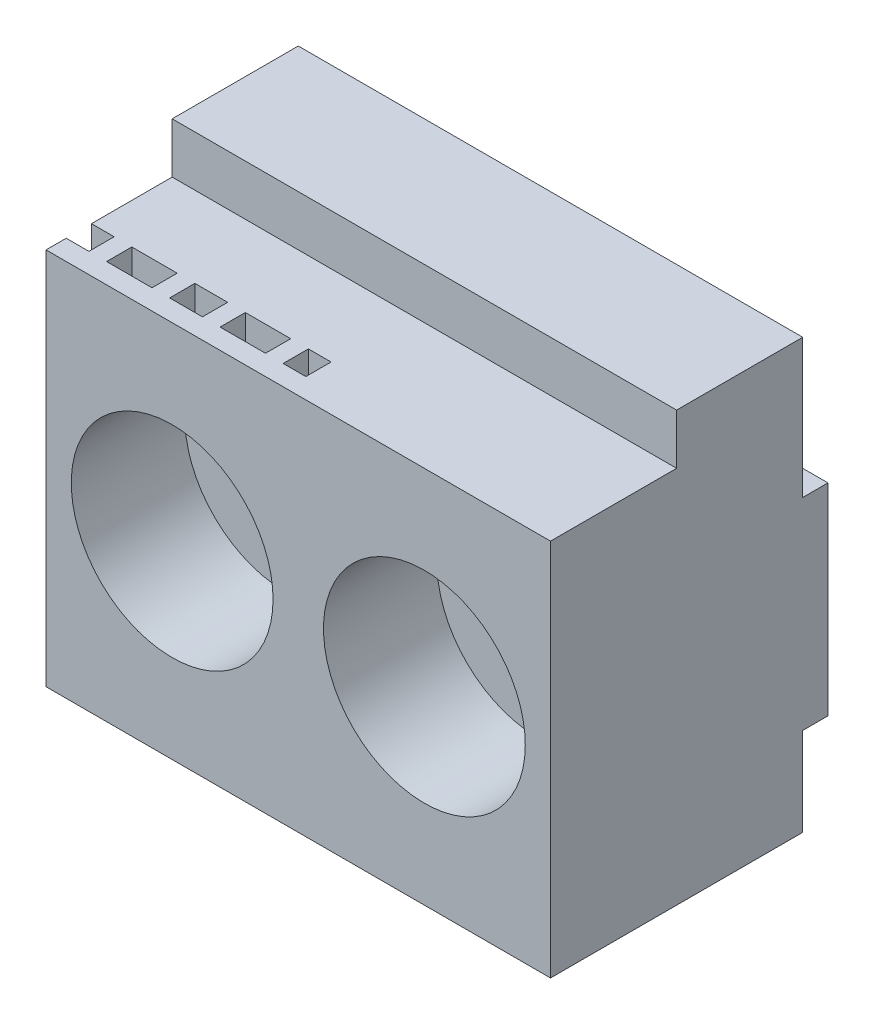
ISO-10303-21;
HEADER;
FILE_DESCRIPTION(('STEP AP214'),'2;1');
FILE_NAME('part.step','',(''),(''),'','','');
FILE_SCHEMA(('AUTOMOTIVE_DESIGN { 1 0 10303 214 1 1 1 1 }'));
ENDSEC;
DATA;
#1=APPLICATION_CONTEXT('core data for automotive mechanical design processes');
#2=APPLICATION_PROTOCOL_DEFINITION('international standard','automotive_design',2000,#1);
#3=PRODUCT_CONTEXT('',#1,'mechanical');
#4=PRODUCT('Part','Part','',(#3));
#5=PRODUCT_RELATED_PRODUCT_CATEGORY('part','',(#4));
#6=PRODUCT_DEFINITION_FORMATION('','',#4);
#7=PRODUCT_DEFINITION_CONTEXT('part definition',#1,'design');
#8=PRODUCT_DEFINITION('design','',#6,#7);
#9=PRODUCT_DEFINITION_SHAPE('','',#8);
#10=(LENGTH_UNIT() NAMED_UNIT(*) SI_UNIT(.MILLI.,.METRE.));
#11=(NAMED_UNIT(*) PLANE_ANGLE_UNIT() SI_UNIT($,.RADIAN.));
#12=(NAMED_UNIT(*) SI_UNIT($,.STERADIAN.) SOLID_ANGLE_UNIT());
#13=UNCERTAINTY_MEASURE_WITH_UNIT(LENGTH_MEASURE(1.E-05),#10,'distance_accuracy_value','');
#14=(GEOMETRIC_REPRESENTATION_CONTEXT(3) GLOBAL_UNCERTAINTY_ASSIGNED_CONTEXT((#13)) GLOBAL_UNIT_ASSIGNED_CONTEXT((#10,
#11,#12)) REPRESENTATION_CONTEXT('',''));
#15=CARTESIAN_POINT('',(0.,0.,0.));
#16=DIRECTION('',(0.,0.,1.));
#17=DIRECTION('',(1.,0.,0.));
#18=AXIS2_PLACEMENT_3D('',#15,#16,#17);
#19=CARTESIAN_POINT('',(20.,0.,11.));
#20=DIRECTION('',(0.,0.,1.));
#21=DIRECTION('',(1.,0.,0.));
#22=AXIS2_PLACEMENT_3D('',#19,#20,#21);
#23=PLANE('',#22);
#24=CARTESIAN_POINT('',(5.,7.50000000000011,11.));
#25=DIRECTION('',(0.,0.,1.));
#26=DIRECTION('',(1.,0.,0.));
#27=AXIS2_PLACEMENT_3D('',#24,#25,#26);
#28=CIRCLE('',#27,4.);
#29=CARTESIAN_POINT('',(9.,7.50000000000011,11.));
#30=VERTEX_POINT('',#29);
#31=EDGE_CURVE('E459',#30,#30,#28,.T.);
#32=ORIENTED_EDGE('',*,*,#31,.F.);
#33=EDGE_LOOP('',(#32));
#34=FACE_BOUND('',#33,.T.);
#35=CARTESIAN_POINT('',(15.,7.50000000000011,11.));
#36=DIRECTION('',(0.,0.,1.));
#37=DIRECTION('',(1.,0.,0.));
#38=AXIS2_PLACEMENT_3D('',#35,#36,#37);
#39=CIRCLE('',#38,4.);
#40=CARTESIAN_POINT('',(19.,7.50000000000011,11.));
#41=VERTEX_POINT('',#40);
#42=EDGE_CURVE('E431',#41,#41,#39,.T.);
#43=ORIENTED_EDGE('',*,*,#42,.F.);
#44=EDGE_LOOP('',(#43));
#45=FACE_BOUND('',#44,.T.);
#46=DIRECTION('',(0.,1.,0.));
#47=VECTOR('',#46,1.);
#48=CARTESIAN_POINT('',(20.,0.,11.));
#49=LINE('',#48,#47);
#50=CARTESIAN_POINT('',(20.,0.,11.));
#51=VERTEX_POINT('',#50);
#52=CARTESIAN_POINT('',(20.,14.9999999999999,10.9999999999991));
#53=VERTEX_POINT('',#52);
#54=EDGE_CURVE('E472',#51,#53,#49,.T.);
#55=ORIENTED_EDGE('',*,*,#54,.T.);
#56=DIRECTION('',(1.,0.,0.));
#57=VECTOR('',#56,1.);
#58=CARTESIAN_POINT('',(0.,14.9999999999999,10.9999999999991));
#59=LINE('',#58,#57);
#60=CARTESIAN_POINT('',(0.,14.9999999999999,10.9999999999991));
#61=VERTEX_POINT('',#60);
#62=EDGE_CURVE('E411',#61,#53,#59,.T.);
#63=ORIENTED_EDGE('',*,*,#62,.F.);
#64=DIRECTION('',(0.,-1.,0.));
#65=VECTOR('',#64,1.);
#66=CARTESIAN_POINT('',(0.,0.,11.));
#67=LINE('',#66,#65);
#68=CARTESIAN_POINT('',(0.,0.,11.));
#69=VERTEX_POINT('',#68);
#70=EDGE_CURVE('E476',#61,#69,#67,.T.);
#71=ORIENTED_EDGE('',*,*,#70,.T.);
#72=DIRECTION('',(1.,0.,0.));
#73=VECTOR('',#72,1.);
#74=CARTESIAN_POINT('',(0.,0.,11.));
#75=LINE('',#74,#73);
#76=EDGE_CURVE('E469',#69,#51,#75,.T.);
#77=ORIENTED_EDGE('',*,*,#76,.T.);
#78=EDGE_LOOP('',(#55,#63,#71,#77));
#79=FACE_BOUND('',#78,.T.);
#80=ADVANCED_FACE('F33',(#34,#45,#79),#23,.T.);
#81=CARTESIAN_POINT('',(20.,0.,0.));
#82=DIRECTION('',(0.,0.,1.));
#83=DIRECTION('',(1.,0.,0.));
#84=AXIS2_PLACEMENT_3D('',#81,#82,#83);
#85=PLANE('',#84);
#86=CARTESIAN_POINT('',(5.,7.50000000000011,0.));
#87=DIRECTION('',(0.,0.,1.));
#88=DIRECTION('',(1.,0.,0.));
#89=AXIS2_PLACEMENT_3D('',#86,#87,#88);
#90=CIRCLE('',#89,2.25);
#91=CARTESIAN_POINT('',(7.25,7.50000000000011,0.));
#92=VERTEX_POINT('',#91);
#93=EDGE_CURVE('E465',#92,#92,#90,.T.);
#94=ORIENTED_EDGE('',*,*,#93,.T.);
#95=EDGE_LOOP('',(#94));
#96=FACE_BOUND('',#95,.T.);
#97=CARTESIAN_POINT('',(15.,7.50000000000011,0.));
#98=DIRECTION('',(0.,0.,1.));
#99=DIRECTION('',(1.,0.,0.));
#100=AXIS2_PLACEMENT_3D('',#97,#98,#99);
#101=CIRCLE('',#100,2.25);
#102=CARTESIAN_POINT('',(17.25,7.50000000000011,0.));
#103=VERTEX_POINT('',#102);
#104=EDGE_CURVE('E462',#103,#103,#101,.T.);
#105=ORIENTED_EDGE('',*,*,#104,.T.);
#106=EDGE_LOOP('',(#105));
#107=FACE_BOUND('',#106,.T.);
#108=DIRECTION('',(1.,0.,0.));
#109=VECTOR('',#108,1.);
#110=CARTESIAN_POINT('',(0.,11.4999999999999,-9.09494701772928E-13));
#111=LINE('',#110,#109);
#112=CARTESIAN_POINT('',(0.,11.4999999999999,0.));
#113=VERTEX_POINT('',#112);
#114=CARTESIAN_POINT('',(20.,11.4999999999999,-9.09494701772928E-13));
#115=VERTEX_POINT('',#114);
#116=EDGE_CURVE('E439',#113,#115,#111,.T.);
#117=ORIENTED_EDGE('',*,*,#116,.T.);
#118=DIRECTION('',(0.,1.,0.));
#119=VECTOR('',#118,1.);
#120=CARTESIAN_POINT('',(20.,0.,0.));
#121=LINE('',#120,#119);
#122=CARTESIAN_POINT('',(20.,3.49999999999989,-9.09494701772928E-13));
#123=VERTEX_POINT('',#122);
#124=EDGE_CURVE('E468',#123,#115,#121,.T.);
#125=ORIENTED_EDGE('',*,*,#124,.F.);
#126=DIRECTION('',(1.,0.,0.));
#127=VECTOR('',#126,1.);
#128=CARTESIAN_POINT('',(0.,3.49999999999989,-9.09494701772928E-13));
#129=LINE('',#128,#127);
#130=CARTESIAN_POINT('',(0.,3.49999999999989,-9.09494701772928E-13));
#131=VERTEX_POINT('',#130);
#132=EDGE_CURVE('E442',#131,#123,#129,.T.);
#133=ORIENTED_EDGE('',*,*,#132,.F.);
#134=DIRECTION('',(0.,-1.,0.));
#135=VECTOR('',#134,1.);
#136=CARTESIAN_POINT('',(0.,0.,0.));
#137=LINE('',#136,#135);
#138=EDGE_CURVE('E473',#113,#131,#137,.T.);
#139=ORIENTED_EDGE('',*,*,#138,.F.);
#140=EDGE_LOOP('',(#117,#125,#133,#139));
#141=FACE_BOUND('',#140,.T.);
#142=ADVANCED_FACE('F509',(#96,#107,#141),#85,.F.);
#143=CARTESIAN_POINT('',(0.,0.,11.));
#144=DIRECTION('',(0.,1.,0.));
#145=DIRECTION('',(0.,0.,1.));
#146=AXIS2_PLACEMENT_3D('',#143,#144,#145);
#147=PLANE('',#146);
#148=DIRECTION('',(1.,0.,0.));
#149=VECTOR('',#148,1.);
#150=CARTESIAN_POINT('',(0.,-1.13686837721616E-13,0.999999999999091));
#151=LINE('',#150,#149);
#152=CARTESIAN_POINT('',(0.,0.,0.99999999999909));
#153=VERTEX_POINT('',#152);
#154=CARTESIAN_POINT('',(20.,-1.13686837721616E-13,0.999999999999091));
#155=VERTEX_POINT('',#154);
#156=EDGE_CURVE('E446',#153,#155,#151,.T.);
#157=ORIENTED_EDGE('',*,*,#156,.T.);
#158=DIRECTION('',(0.,0.,-1.));
#159=VECTOR('',#158,1.);
#160=CARTESIAN_POINT('',(20.,0.,11.));
#161=LINE('',#160,#159);
#162=EDGE_CURVE('E12',#51,#155,#161,.T.);
#163=ORIENTED_EDGE('',*,*,#162,.F.);
#164=ORIENTED_EDGE('',*,*,#76,.F.);
#165=DIRECTION('',(0.,0.,-1.));
#166=VECTOR('',#165,1.);
#167=CARTESIAN_POINT('',(0.,0.,11.));
#168=LINE('',#167,#166);
#169=EDGE_CURVE('E478',#69,#153,#168,.T.);
#170=ORIENTED_EDGE('',*,*,#169,.T.);
#171=EDGE_LOOP('',(#157,#163,#164,#170));
#172=FACE_BOUND('',#171,.T.);
#173=ADVANCED_FACE('F35',(#172),#147,.F.);
#174=CARTESIAN_POINT('',(20.,0.,11.));
#175=DIRECTION('',(-1.,0.,0.));
#176=DIRECTION('',(0.,0.,1.));
#177=AXIS2_PLACEMENT_3D('',#174,#175,#176);
#178=PLANE('',#177);
#179=DIRECTION('',(0.,0.,1.));
#180=VECTOR('',#179,1.);
#181=CARTESIAN_POINT('',(20.,14.9999999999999,10.9999999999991));
#182=LINE('',#181,#180);
#183=CARTESIAN_POINT('',(20.,14.9999999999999,5.99999999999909));
#184=VERTEX_POINT('',#183);
#185=EDGE_CURVE('E388',#184,#53,#182,.T.);
#186=ORIENTED_EDGE('',*,*,#185,.T.);
#187=ORIENTED_EDGE('',*,*,#54,.F.);
#188=ORIENTED_EDGE('',*,*,#162,.T.);
#189=DIRECTION('',(0.,1.,0.));
#190=VECTOR('',#189,1.);
#191=CARTESIAN_POINT('',(20.,-1.13686837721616E-13,0.999999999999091));
#192=LINE('',#191,#190);
#193=CARTESIAN_POINT('',(20.,3.49999999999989,0.999999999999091));
#194=VERTEX_POINT('',#193);
#195=EDGE_CURVE('E414',#155,#194,#192,.T.);
#196=ORIENTED_EDGE('',*,*,#195,.T.);
#197=DIRECTION('',(0.,0.,-1.));
#198=VECTOR('',#197,1.);
#199=CARTESIAN_POINT('',(20.,3.49999999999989,0.999999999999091));
#200=LINE('',#199,#198);
#201=EDGE_CURVE('E417',#194,#123,#200,.T.);
#202=ORIENTED_EDGE('',*,*,#201,.T.);
#203=ORIENTED_EDGE('',*,*,#124,.T.);
#204=DIRECTION('',(0.,0.,1.));
#205=VECTOR('',#204,1.);
#206=CARTESIAN_POINT('',(20.,11.4999999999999,0.999999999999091));
#207=LINE('',#206,#205);
#208=CARTESIAN_POINT('',(20.,11.4999999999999,0.999999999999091));
#209=VERTEX_POINT('',#208);
#210=EDGE_CURVE('E420',#115,#209,#207,.T.);
#211=ORIENTED_EDGE('',*,*,#210,.T.);
#212=DIRECTION('',(0.,1.,0.));
#213=VECTOR('',#212,1.);
#214=CARTESIAN_POINT('',(20.,11.4999999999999,0.999999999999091));
#215=LINE('',#214,#213);
#216=CARTESIAN_POINT('',(20.,16.9999999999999,0.999999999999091));
#217=VERTEX_POINT('',#216);
#218=EDGE_CURVE('E423',#209,#217,#215,.T.);
#219=ORIENTED_EDGE('',*,*,#218,.T.);
#220=DIRECTION('',(0.,0.,-1.));
#221=VECTOR('',#220,1.);
#222=CARTESIAN_POINT('',(20.,17.,11.));
#223=LINE('',#222,#221);
#224=CARTESIAN_POINT('',(20.,16.9999999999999,5.99999999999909));
#225=VERTEX_POINT('',#224);
#226=EDGE_CURVE('E42',#225,#217,#223,.T.);
#227=ORIENTED_EDGE('',*,*,#226,.F.);
#228=DIRECTION('',(0.,-1.,0.));
#229=VECTOR('',#228,1.);
#230=CARTESIAN_POINT('',(20.,14.9999999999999,5.99999999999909));
#231=LINE('',#230,#229);
#232=EDGE_CURVE('E426',#225,#184,#231,.T.);
#233=ORIENTED_EDGE('',*,*,#232,.T.);
#234=EDGE_LOOP('',(#186,#187,#188,#196,#202,#203,#211,#219,#227,#233));
#235=FACE_BOUND('',#234,.T.);
#236=ADVANCED_FACE('F518',(#235),#178,.F.);
#237=CARTESIAN_POINT('',(0.,17.,11.));
#238=DIRECTION('',(0.,-1.,0.));
#239=DIRECTION('',(0.,0.,-1.));
#240=AXIS2_PLACEMENT_3D('',#237,#238,#239);
#241=PLANE('',#240);
#242=DIRECTION('',(1.,0.,0.));
#243=VECTOR('',#242,1.);
#244=CARTESIAN_POINT('',(0.,16.9999999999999,5.99999999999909));
#245=LINE('',#244,#243);
#246=CARTESIAN_POINT('',(0.,17.,5.99999999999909));
#247=VERTEX_POINT('',#246);
#248=EDGE_CURVE('E432',#247,#225,#245,.T.);
#249=ORIENTED_EDGE('',*,*,#248,.T.);
#250=ORIENTED_EDGE('',*,*,#226,.T.);
#251=DIRECTION('',(1.,0.,0.));
#252=VECTOR('',#251,1.);
#253=CARTESIAN_POINT('',(0.,16.9999999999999,0.999999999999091));
#254=LINE('',#253,#252);
#255=CARTESIAN_POINT('',(0.,16.9999999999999,0.999999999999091));
#256=VERTEX_POINT('',#255);
#257=EDGE_CURVE('E435',#256,#217,#254,.T.);
#258=ORIENTED_EDGE('',*,*,#257,.F.);
#259=DIRECTION('',(0.,0.,-1.));
#260=VECTOR('',#259,1.);
#261=CARTESIAN_POINT('',(0.,17.,11.));
#262=LINE('',#261,#260);
#263=EDGE_CURVE('E485',#247,#256,#262,.T.);
#264=ORIENTED_EDGE('',*,*,#263,.F.);
#265=EDGE_LOOP('',(#249,#250,#258,#264));
#266=FACE_BOUND('',#265,.T.);
#267=ADVANCED_FACE('F554',(#266),#241,.F.);
#268=CARTESIAN_POINT('',(0.,0.,11.));
#269=DIRECTION('',(1.,0.,0.));
#270=DIRECTION('',(0.,0.,-1.));
#271=AXIS2_PLACEMENT_3D('',#268,#269,#270);
#272=PLANE('',#271);
#273=DIRECTION('',(0.,0.,1.));
#274=VECTOR('',#273,1.);
#275=CARTESIAN_POINT('',(0.,11.9999999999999,9.20000000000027));
#276=LINE('',#275,#274);
#277=CARTESIAN_POINT('',(0.,11.9999999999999,9.20000000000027));
#278=VERTEX_POINT('',#277);
#279=CARTESIAN_POINT('',(0.,11.9999999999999,10.2000000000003));
#280=VERTEX_POINT('',#279);
#281=EDGE_CURVE('E365',#278,#280,#276,.T.);
#282=ORIENTED_EDGE('',*,*,#281,.F.);
#283=DIRECTION('',(0.,1.,0.));
#284=VECTOR('',#283,1.);
#285=CARTESIAN_POINT('',(0.,11.9999999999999,9.20000000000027));
#286=LINE('',#285,#284);
#287=CARTESIAN_POINT('',(0.,14.9999999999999,9.20000000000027));
#288=VERTEX_POINT('',#287);
#289=EDGE_CURVE('E385',#278,#288,#286,.T.);
#290=ORIENTED_EDGE('',*,*,#289,.T.);
#291=DIRECTION('',(0.,0.,1.));
#292=VECTOR('',#291,1.);
#293=CARTESIAN_POINT('',(0.,14.9999999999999,10.9999999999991));
#294=LINE('',#293,#292);
#295=CARTESIAN_POINT('',(0.,14.9999999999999,5.99999999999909));
#296=VERTEX_POINT('',#295);
#297=EDGE_CURVE('E394',#296,#288,#294,.T.);
#298=ORIENTED_EDGE('',*,*,#297,.F.);
#299=DIRECTION('',(0.,-1.,0.));
#300=VECTOR('',#299,1.);
#301=CARTESIAN_POINT('',(0.,14.9999999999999,5.99999999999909));
#302=LINE('',#301,#300);
#303=EDGE_CURVE('E408',#247,#296,#302,.T.);
#304=ORIENTED_EDGE('',*,*,#303,.F.);
#305=ORIENTED_EDGE('',*,*,#263,.T.);
#306=DIRECTION('',(0.,1.,0.));
#307=VECTOR('',#306,1.);
#308=CARTESIAN_POINT('',(0.,11.4999999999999,0.999999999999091));
#309=LINE('',#308,#307);
#310=CARTESIAN_POINT('',(0.,11.4999999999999,0.999999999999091));
#311=VERTEX_POINT('',#310);
#312=EDGE_CURVE('E406',#311,#256,#309,.T.);
#313=ORIENTED_EDGE('',*,*,#312,.F.);
#314=DIRECTION('',(0.,0.,1.));
#315=VECTOR('',#314,1.);
#316=CARTESIAN_POINT('',(0.,11.4999999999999,0.999999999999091));
#317=LINE('',#316,#315);
#318=EDGE_CURVE('E403',#113,#311,#317,.T.);
#319=ORIENTED_EDGE('',*,*,#318,.F.);
#320=ORIENTED_EDGE('',*,*,#138,.T.);
#321=DIRECTION('',(0.,0.,-1.));
#322=VECTOR('',#321,1.);
#323=CARTESIAN_POINT('',(0.,3.49999999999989,0.999999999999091));
#324=LINE('',#323,#322);
#325=CARTESIAN_POINT('',(0.,3.49999999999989,0.999999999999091));
#326=VERTEX_POINT('',#325);
#327=EDGE_CURVE('E401',#326,#131,#324,.T.);
#328=ORIENTED_EDGE('',*,*,#327,.F.);
#329=DIRECTION('',(0.,1.,0.));
#330=VECTOR('',#329,1.);
#331=CARTESIAN_POINT('',(0.,-1.13686837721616E-13,0.999999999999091));
#332=LINE('',#331,#330);
#333=EDGE_CURVE('E397',#153,#326,#332,.T.);
#334=ORIENTED_EDGE('',*,*,#333,.F.);
#335=ORIENTED_EDGE('',*,*,#169,.F.);
#336=ORIENTED_EDGE('',*,*,#70,.F.);
#337=CARTESIAN_POINT('',(0.,14.9999999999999,10.2000000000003));
#338=VERTEX_POINT('',#337);
#339=EDGE_CURVE('E398',#338,#61,#294,.T.);
#340=ORIENTED_EDGE('',*,*,#339,.F.);
#341=DIRECTION('',(0.,1.,0.));
#342=VECTOR('',#341,1.);
#343=CARTESIAN_POINT('',(0.,11.9999999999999,10.2000000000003));
#344=LINE('',#343,#342);
#345=EDGE_CURVE('E378',#280,#338,#344,.T.);
#346=ORIENTED_EDGE('',*,*,#345,.F.);
#347=EDGE_LOOP('',(#282,#290,#298,#304,#305,#313,#319,#320,#328,#334,#335,#336,#340,#346));
#348=FACE_BOUND('',#347,.T.);
#349=ADVANCED_FACE('F530',(#348),#272,.F.);
#350=CARTESIAN_POINT('',(15.,7.50000000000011,11.));
#351=DIRECTION('',(0.,0.,-1.));
#352=DIRECTION('',(-1.,0.,0.));
#353=AXIS2_PLACEMENT_3D('',#350,#351,#352);
#354=CYLINDRICAL_SURFACE('',#353,2.25);
#355=ORIENTED_EDGE('',*,*,#104,.F.);
#356=EDGE_LOOP('',(#355));
#357=FACE_BOUND('',#356,.T.);
#358=CARTESIAN_POINT('',(15.,7.50000000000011,6.5));
#359=DIRECTION('',(0.,0.,1.));
#360=DIRECTION('',(1.,0.,0.));
#361=AXIS2_PLACEMENT_3D('',#358,#359,#360);
#362=CIRCLE('',#361,2.25);
#363=CARTESIAN_POINT('',(17.25,7.50000000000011,6.5));
#364=VERTEX_POINT('',#363);
#365=EDGE_CURVE('E37',#364,#364,#362,.T.);
#366=ORIENTED_EDGE('',*,*,#365,.T.);
#367=EDGE_LOOP('',(#366));
#368=FACE_BOUND('',#367,.T.);
#369=ADVANCED_FACE('F606',(#357,#368),#354,.F.);
#370=CARTESIAN_POINT('',(5.,7.50000000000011,11.));
#371=DIRECTION('',(0.,0.,-1.));
#372=DIRECTION('',(-1.,0.,0.));
#373=AXIS2_PLACEMENT_3D('',#370,#371,#372);
#374=CYLINDRICAL_SURFACE('',#373,2.25);
#375=ORIENTED_EDGE('',*,*,#93,.F.);
#376=EDGE_LOOP('',(#375));
#377=FACE_BOUND('',#376,.T.);
#378=CARTESIAN_POINT('',(5.,7.50000000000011,6.5));
#379=DIRECTION('',(0.,0.,1.));
#380=DIRECTION('',(1.,0.,0.));
#381=AXIS2_PLACEMENT_3D('',#378,#379,#380);
#382=CIRCLE('',#381,2.25);
#383=CARTESIAN_POINT('',(7.25,7.50000000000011,6.5));
#384=VERTEX_POINT('',#383);
#385=EDGE_CURVE('E458',#384,#384,#382,.T.);
#386=ORIENTED_EDGE('',*,*,#385,.T.);
#387=EDGE_LOOP('',(#386));
#388=FACE_BOUND('',#387,.T.);
#389=ADVANCED_FACE('F492',(#377,#388),#374,.F.);
#390=CARTESIAN_POINT('',(5.,7.50000000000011,6.5));
#391=DIRECTION('',(0.,0.,1.));
#392=DIRECTION('',(1.,0.,0.));
#393=AXIS2_PLACEMENT_3D('',#390,#391,#392);
#394=CYLINDRICAL_SURFACE('',#393,4.);
#395=CARTESIAN_POINT('',(5.,7.50000000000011,6.5));
#396=DIRECTION('',(0.,0.,1.));
#397=DIRECTION('',(1.,0.,0.));
#398=AXIS2_PLACEMENT_3D('',#395,#396,#397);
#399=CIRCLE('',#398,4.);
#400=CARTESIAN_POINT('',(9.,7.50000000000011,6.5));
#401=VERTEX_POINT('',#400);
#402=EDGE_CURVE('E455',#401,#401,#399,.T.);
#403=ORIENTED_EDGE('',*,*,#402,.F.);
#404=EDGE_LOOP('',(#403));
#405=FACE_BOUND('',#404,.T.);
#406=ORIENTED_EDGE('',*,*,#31,.T.);
#407=EDGE_LOOP('',(#406));
#408=FACE_BOUND('',#407,.T.);
#409=ADVANCED_FACE('F498',(#405,#408),#394,.F.);
#410=CARTESIAN_POINT('',(5.,7.50000000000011,6.5));
#411=DIRECTION('',(0.,0.,1.));
#412=DIRECTION('',(1.,0.,0.));
#413=AXIS2_PLACEMENT_3D('',#410,#411,#412);
#414=PLANE('',#413);
#415=ORIENTED_EDGE('',*,*,#385,.F.);
#416=EDGE_LOOP('',(#415));
#417=FACE_BOUND('',#416,.T.);
#418=ORIENTED_EDGE('',*,*,#402,.T.);
#419=EDGE_LOOP('',(#418));
#420=FACE_BOUND('',#419,.T.);
#421=ADVANCED_FACE('F494',(#417,#420),#414,.T.);
#422=CARTESIAN_POINT('',(15.,7.50000000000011,6.5));
#423=DIRECTION('',(0.,0.,1.));
#424=DIRECTION('',(1.,0.,0.));
#425=AXIS2_PLACEMENT_3D('',#422,#423,#424);
#426=CYLINDRICAL_SURFACE('',#425,4.);
#427=CARTESIAN_POINT('',(15.,7.50000000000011,6.5));
#428=DIRECTION('',(0.,0.,1.));
#429=DIRECTION('',(1.,0.,0.));
#430=AXIS2_PLACEMENT_3D('',#427,#428,#429);
#431=CIRCLE('',#430,4.);
#432=CARTESIAN_POINT('',(19.,7.50000000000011,6.5));
#433=VERTEX_POINT('',#432);
#434=EDGE_CURVE('E450',#433,#433,#431,.T.);
#435=ORIENTED_EDGE('',*,*,#434,.F.);
#436=EDGE_LOOP('',(#435));
#437=FACE_BOUND('',#436,.T.);
#438=ORIENTED_EDGE('',*,*,#42,.T.);
#439=EDGE_LOOP('',(#438));
#440=FACE_BOUND('',#439,.T.);
#441=ADVANCED_FACE('F497',(#437,#440),#426,.F.);
#442=CARTESIAN_POINT('',(15.,7.50000000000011,6.5));
#443=DIRECTION('',(0.,0.,1.));
#444=DIRECTION('',(1.,0.,0.));
#445=AXIS2_PLACEMENT_3D('',#442,#443,#444);
#446=PLANE('',#445);
#447=ORIENTED_EDGE('',*,*,#365,.F.);
#448=EDGE_LOOP('',(#447));
#449=FACE_BOUND('',#448,.T.);
#450=ORIENTED_EDGE('',*,*,#434,.T.);
#451=EDGE_LOOP('',(#450));
#452=FACE_BOUND('',#451,.T.);
#453=ADVANCED_FACE('F596',(#449,#452),#446,.T.);
#454=CARTESIAN_POINT('',(0.,-1.13686837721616E-13,0.999999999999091));
#455=DIRECTION('',(0.,0.,-1.));
#456=DIRECTION('',(-1.,0.,0.));
#457=AXIS2_PLACEMENT_3D('',#454,#455,#456);
#458=PLANE('',#457);
#459=ORIENTED_EDGE('',*,*,#195,.F.);
#460=ORIENTED_EDGE('',*,*,#156,.F.);
#461=ORIENTED_EDGE('',*,*,#333,.T.);
#462=DIRECTION('',(1.,0.,0.));
#463=VECTOR('',#462,1.);
#464=CARTESIAN_POINT('',(0.,3.49999999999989,0.999999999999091));
#465=LINE('',#464,#463);
#466=EDGE_CURVE('E444',#326,#194,#465,.T.);
#467=ORIENTED_EDGE('',*,*,#466,.T.);
#468=EDGE_LOOP('',(#459,#460,#461,#467));
#469=FACE_BOUND('',#468,.T.);
#470=ADVANCED_FACE('F536',(#469),#458,.T.);
#471=CARTESIAN_POINT('',(0.,3.49999999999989,0.999999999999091));
#472=DIRECTION('',(0.,-1.,0.));
#473=DIRECTION('',(0.,0.,-1.));
#474=AXIS2_PLACEMENT_3D('',#471,#472,#473);
#475=PLANE('',#474);
#476=ORIENTED_EDGE('',*,*,#201,.F.);
#477=ORIENTED_EDGE('',*,*,#466,.F.);
#478=ORIENTED_EDGE('',*,*,#327,.T.);
#479=ORIENTED_EDGE('',*,*,#132,.T.);
#480=EDGE_LOOP('',(#476,#477,#478,#479));
#481=FACE_BOUND('',#480,.T.);
#482=ADVANCED_FACE('F591',(#481),#475,.T.);
#483=CARTESIAN_POINT('',(0.,11.4999999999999,0.999999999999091));
#484=DIRECTION('',(0.,1.,0.));
#485=DIRECTION('',(0.,0.,1.));
#486=AXIS2_PLACEMENT_3D('',#483,#484,#485);
#487=PLANE('',#486);
#488=ORIENTED_EDGE('',*,*,#210,.F.);
#489=ORIENTED_EDGE('',*,*,#116,.F.);
#490=ORIENTED_EDGE('',*,*,#318,.T.);
#491=DIRECTION('',(1.,0.,0.));
#492=VECTOR('',#491,1.);
#493=CARTESIAN_POINT('',(0.,11.4999999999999,0.999999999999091));
#494=LINE('',#493,#492);
#495=EDGE_CURVE('E437',#311,#209,#494,.T.);
#496=ORIENTED_EDGE('',*,*,#495,.T.);
#497=EDGE_LOOP('',(#488,#489,#490,#496));
#498=FACE_BOUND('',#497,.T.);
#499=ADVANCED_FACE('F545',(#498),#487,.T.);
#500=CARTESIAN_POINT('',(0.,11.4999999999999,0.999999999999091));
#501=DIRECTION('',(0.,0.,-1.));
#502=DIRECTION('',(-1.,0.,0.));
#503=AXIS2_PLACEMENT_3D('',#500,#501,#502);
#504=PLANE('',#503);
#505=ORIENTED_EDGE('',*,*,#218,.F.);
#506=ORIENTED_EDGE('',*,*,#495,.F.);
#507=ORIENTED_EDGE('',*,*,#312,.T.);
#508=ORIENTED_EDGE('',*,*,#257,.T.);
#509=EDGE_LOOP('',(#505,#506,#507,#508));
#510=FACE_BOUND('',#509,.T.);
#511=ADVANCED_FACE('F552',(#510),#504,.T.);
#512=CARTESIAN_POINT('',(0.,14.9999999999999,10.9999999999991));
#513=DIRECTION('',(0.,1.,0.));
#514=DIRECTION('',(0.,0.,1.));
#515=AXIS2_PLACEMENT_3D('',#512,#513,#514);
#516=PLANE('',#515);
#517=DIRECTION('',(1.,0.,0.));
#518=VECTOR('',#517,1.);
#519=CARTESIAN_POINT('',(8.59999999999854,14.9999999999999,10.2000000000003));
#520=LINE('',#519,#518);
#521=CARTESIAN_POINT('',(8.59999999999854,14.9999999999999,10.2000000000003));
#522=VERTEX_POINT('',#521);
#523=CARTESIAN_POINT('',(9.5,14.9999999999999,10.2000000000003));
#524=VERTEX_POINT('',#523);
#525=EDGE_CURVE('E50',#522,#524,#520,.T.);
#526=ORIENTED_EDGE('',*,*,#525,.F.);
#527=DIRECTION('',(0.,0.,1.));
#528=VECTOR('',#527,1.);
#529=CARTESIAN_POINT('',(8.59999999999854,14.9999999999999,10.2000000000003));
#530=LINE('',#529,#528);
#531=CARTESIAN_POINT('',(8.59999999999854,14.9999999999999,9.20000000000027));
#532=VERTEX_POINT('',#531);
#533=EDGE_CURVE('E252',#532,#522,#530,.T.);
#534=ORIENTED_EDGE('',*,*,#533,.F.);
#535=DIRECTION('',(-1.,0.,0.));
#536=VECTOR('',#535,1.);
#537=CARTESIAN_POINT('',(8.59999999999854,14.9999999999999,9.20000000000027));
#538=LINE('',#537,#536);
#539=CARTESIAN_POINT('',(9.5,14.9999999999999,9.20000000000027));
#540=VERTEX_POINT('',#539);
#541=EDGE_CURVE('E255',#540,#532,#538,.T.);
#542=ORIENTED_EDGE('',*,*,#541,.F.);
#543=DIRECTION('',(0.,0.,-1.));
#544=VECTOR('',#543,1.);
#545=CARTESIAN_POINT('',(9.5,14.9999999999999,9.20000000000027));
#546=LINE('',#545,#544);
#547=EDGE_CURVE('E261',#524,#540,#546,.T.);
#548=ORIENTED_EDGE('',*,*,#547,.F.);
#549=EDGE_LOOP('',(#526,#534,#542,#548));
#550=FACE_BOUND('',#549,.T.);
#551=DIRECTION('',(1.,0.,0.));
#552=VECTOR('',#551,1.);
#553=CARTESIAN_POINT('',(6.09999999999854,14.9999999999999,10.2000000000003));
#554=LINE('',#553,#552);
#555=CARTESIAN_POINT('',(6.09999999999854,14.9999999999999,10.2000000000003));
#556=VERTEX_POINT('',#555);
#557=CARTESIAN_POINT('',(7.89999999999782,14.9999999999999,10.2000000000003));
#558=VERTEX_POINT('',#557);
#559=EDGE_CURVE('E58',#556,#558,#554,.T.);
#560=ORIENTED_EDGE('',*,*,#559,.F.);
#561=DIRECTION('',(0.,0.,1.));
#562=VECTOR('',#561,1.);
#563=CARTESIAN_POINT('',(6.09999999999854,14.9999999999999,10.2000000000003));
#564=LINE('',#563,#562);
#565=CARTESIAN_POINT('',(6.09999999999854,14.9999999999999,9.20000000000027));
#566=VERTEX_POINT('',#565);
#567=EDGE_CURVE('E274',#566,#556,#564,.T.);
#568=ORIENTED_EDGE('',*,*,#567,.F.);
#569=DIRECTION('',(-1.,0.,0.));
#570=VECTOR('',#569,1.);
#571=CARTESIAN_POINT('',(6.09999999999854,14.9999999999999,9.20000000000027));
#572=LINE('',#571,#570);
#573=CARTESIAN_POINT('',(7.89999999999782,14.9999999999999,9.20000000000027));
#574=VERTEX_POINT('',#573);
#575=EDGE_CURVE('E288',#574,#566,#572,.T.);
#576=ORIENTED_EDGE('',*,*,#575,.F.);
#577=DIRECTION('',(0.,0.,-1.));
#578=VECTOR('',#577,1.);
#579=CARTESIAN_POINT('',(7.89999999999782,14.9999999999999,10.2000000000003));
#580=LINE('',#579,#578);
#581=EDGE_CURVE('E285',#558,#574,#580,.T.);
#582=ORIENTED_EDGE('',*,*,#581,.F.);
#583=EDGE_LOOP('',(#560,#568,#576,#582));
#584=FACE_BOUND('',#583,.T.);
#585=DIRECTION('',(1.,0.,0.));
#586=VECTOR('',#585,1.);
#587=CARTESIAN_POINT('',(4.09999999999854,14.9999999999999,10.2000000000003));
#588=LINE('',#587,#586);
#589=CARTESIAN_POINT('',(4.09999999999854,14.9999999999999,10.2000000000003));
#590=VERTEX_POINT('',#589);
#591=CARTESIAN_POINT('',(5.39999999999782,14.9999999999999,10.2000000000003));
#592=VERTEX_POINT('',#591);
#593=EDGE_CURVE('E295',#590,#592,#588,.T.);
#594=ORIENTED_EDGE('',*,*,#593,.F.);
#595=DIRECTION('',(0.,0.,1.));
#596=VECTOR('',#595,1.);
#597=CARTESIAN_POINT('',(4.09999999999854,14.9999999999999,10.2000000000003));
#598=LINE('',#597,#596);
#599=CARTESIAN_POINT('',(4.09999999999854,14.9999999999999,9.20000000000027));
#600=VERTEX_POINT('',#599);
#601=EDGE_CURVE('E305',#600,#590,#598,.T.);
#602=ORIENTED_EDGE('',*,*,#601,.F.);
#603=DIRECTION('',(-1.,0.,0.));
#604=VECTOR('',#603,1.);
#605=CARTESIAN_POINT('',(4.09999999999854,14.9999999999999,9.20000000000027));
#606=LINE('',#605,#604);
#607=CARTESIAN_POINT('',(5.39999999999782,14.9999999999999,9.20000000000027));
#608=VERTEX_POINT('',#607);
#609=EDGE_CURVE('E319',#608,#600,#606,.T.);
#610=ORIENTED_EDGE('',*,*,#609,.F.);
#611=DIRECTION('',(0.,0.,-1.));
#612=VECTOR('',#611,1.);
#613=CARTESIAN_POINT('',(5.39999999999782,14.9999999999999,10.2000000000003));
#614=LINE('',#613,#612);
#615=EDGE_CURVE('E316',#592,#608,#614,.T.);
#616=ORIENTED_EDGE('',*,*,#615,.F.);
#617=EDGE_LOOP('',(#594,#602,#610,#616));
#618=FACE_BOUND('',#617,.T.);
#619=DIRECTION('',(1.,0.,0.));
#620=VECTOR('',#619,1.);
#621=CARTESIAN_POINT('',(1.59999999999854,14.9999999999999,10.2000000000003));
#622=LINE('',#621,#620);
#623=CARTESIAN_POINT('',(1.59999999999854,14.9999999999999,10.2000000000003));
#624=VERTEX_POINT('',#623);
#625=CARTESIAN_POINT('',(3.39999999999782,14.9999999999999,10.2000000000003));
#626=VERTEX_POINT('',#625);
#627=EDGE_CURVE('E326',#624,#626,#622,.T.);
#628=ORIENTED_EDGE('',*,*,#627,.F.);
#629=DIRECTION('',(0.,0.,1.));
#630=VECTOR('',#629,1.);
#631=CARTESIAN_POINT('',(1.59999999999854,14.9999999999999,10.2000000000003));
#632=LINE('',#631,#630);
#633=CARTESIAN_POINT('',(1.59999999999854,14.9999999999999,9.20000000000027));
#634=VERTEX_POINT('',#633);
#635=EDGE_CURVE('E337',#634,#624,#632,.T.);
#636=ORIENTED_EDGE('',*,*,#635,.F.);
#637=DIRECTION('',(-1.,0.,0.));
#638=VECTOR('',#637,1.);
#639=CARTESIAN_POINT('',(1.59999999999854,14.9999999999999,9.20000000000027));
#640=LINE('',#639,#638);
#641=CARTESIAN_POINT('',(3.39999999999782,14.9999999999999,9.20000000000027));
#642=VERTEX_POINT('',#641);
#643=EDGE_CURVE('E351',#642,#634,#640,.T.);
#644=ORIENTED_EDGE('',*,*,#643,.F.);
#645=DIRECTION('',(0.,0.,-1.));
#646=VECTOR('',#645,1.);
#647=CARTESIAN_POINT('',(3.39999999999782,14.9999999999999,10.2000000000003));
#648=LINE('',#647,#646);
#649=EDGE_CURVE('E348',#626,#642,#648,.T.);
#650=ORIENTED_EDGE('',*,*,#649,.F.);
#651=EDGE_LOOP('',(#628,#636,#644,#650));
#652=FACE_BOUND('',#651,.T.);
#653=DIRECTION('',(-1.,0.,0.));
#654=VECTOR('',#653,1.);
#655=CARTESIAN_POINT('',(0.,14.9999999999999,9.20000000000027));
#656=LINE('',#655,#654);
#657=CARTESIAN_POINT('',(0.899999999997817,14.9999999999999,9.20000000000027));
#658=VERTEX_POINT('',#657);
#659=EDGE_CURVE('E369',#658,#288,#656,.T.);
#660=ORIENTED_EDGE('',*,*,#659,.F.);
#661=DIRECTION('',(0.,0.,-1.));
#662=VECTOR('',#661,1.);
#663=CARTESIAN_POINT('',(0.899999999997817,14.9999999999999,10.2000000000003));
#664=LINE('',#663,#662);
#665=CARTESIAN_POINT('',(0.899999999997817,14.9999999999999,10.2000000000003));
#666=VERTEX_POINT('',#665);
#667=EDGE_CURVE('E381',#666,#658,#664,.T.);
#668=ORIENTED_EDGE('',*,*,#667,.F.);
#669=DIRECTION('',(1.,0.,0.));
#670=VECTOR('',#669,1.);
#671=CARTESIAN_POINT('',(0.,14.9999999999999,10.2000000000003));
#672=LINE('',#671,#670);
#673=EDGE_CURVE('E358',#338,#666,#672,.T.);
#674=ORIENTED_EDGE('',*,*,#673,.F.);
#675=ORIENTED_EDGE('',*,*,#339,.T.);
#676=ORIENTED_EDGE('',*,*,#62,.T.);
#677=ORIENTED_EDGE('',*,*,#185,.F.);
#678=DIRECTION('',(1.,0.,0.));
#679=VECTOR('',#678,1.);
#680=CARTESIAN_POINT('',(0.,14.9999999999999,5.99999999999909));
#681=LINE('',#680,#679);
#682=EDGE_CURVE('E429',#296,#184,#681,.T.);
#683=ORIENTED_EDGE('',*,*,#682,.F.);
#684=ORIENTED_EDGE('',*,*,#297,.T.);
#685=EDGE_LOOP('',(#660,#668,#674,#675,#676,#677,#683,#684));
#686=FACE_BOUND('',#685,.T.);
#687=ADVANCED_FACE('F523',(#550,#584,#618,#652,#686),#516,.T.);
#688=CARTESIAN_POINT('',(0.,14.9999999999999,5.99999999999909));
#689=DIRECTION('',(0.,0.,1.));
#690=DIRECTION('',(1.,0.,0.));
#691=AXIS2_PLACEMENT_3D('',#688,#689,#690);
#692=PLANE('',#691);
#693=ORIENTED_EDGE('',*,*,#232,.F.);
#694=ORIENTED_EDGE('',*,*,#248,.F.);
#695=ORIENTED_EDGE('',*,*,#303,.T.);
#696=ORIENTED_EDGE('',*,*,#682,.T.);
#697=EDGE_LOOP('',(#693,#694,#695,#696));
#698=FACE_BOUND('',#697,.T.);
#699=ADVANCED_FACE('F556',(#698),#692,.T.);
#700=CARTESIAN_POINT('',(0.,11.9999999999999,9.20000000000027));
#701=DIRECTION('',(0.,0.,-1.));
#702=DIRECTION('',(-1.,0.,0.));
#703=AXIS2_PLACEMENT_3D('',#700,#701,#702);
#704=PLANE('',#703);
#705=ORIENTED_EDGE('',*,*,#659,.T.);
#706=ORIENTED_EDGE('',*,*,#289,.F.);
#707=DIRECTION('',(-1.,0.,0.));
#708=VECTOR('',#707,1.);
#709=CARTESIAN_POINT('',(0.,11.9999999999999,9.20000000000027));
#710=LINE('',#709,#708);
#711=CARTESIAN_POINT('',(0.899999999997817,11.9999999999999,9.20000000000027));
#712=VERTEX_POINT('',#711);
#713=EDGE_CURVE('E375',#712,#278,#710,.T.);
#714=ORIENTED_EDGE('',*,*,#713,.F.);
#715=DIRECTION('',(0.,1.,0.));
#716=VECTOR('',#715,1.);
#717=CARTESIAN_POINT('',(0.899999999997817,11.9999999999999,9.20000000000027));
#718=LINE('',#717,#716);
#719=EDGE_CURVE('E389',#712,#658,#718,.T.);
#720=ORIENTED_EDGE('',*,*,#719,.T.);
#721=EDGE_LOOP('',(#705,#706,#714,#720));
#722=FACE_BOUND('',#721,.T.);
#723=ADVANCED_FACE('F559',(#722),#704,.F.);
#724=CARTESIAN_POINT('',(0.899999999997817,11.9999999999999,10.2000000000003));
#725=DIRECTION('',(1.,0.,0.));
#726=DIRECTION('',(0.,0.,-1.));
#727=AXIS2_PLACEMENT_3D('',#724,#725,#726);
#728=PLANE('',#727);
#729=ORIENTED_EDGE('',*,*,#667,.T.);
#730=ORIENTED_EDGE('',*,*,#719,.F.);
#731=DIRECTION('',(0.,0.,-1.));
#732=VECTOR('',#731,1.);
#733=CARTESIAN_POINT('',(0.899999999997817,11.9999999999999,10.2000000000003));
#734=LINE('',#733,#732);
#735=CARTESIAN_POINT('',(0.899999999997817,11.9999999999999,10.2000000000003));
#736=VERTEX_POINT('',#735);
#737=EDGE_CURVE('E372',#736,#712,#734,.T.);
#738=ORIENTED_EDGE('',*,*,#737,.F.);
#739=DIRECTION('',(0.,1.,0.));
#740=VECTOR('',#739,1.);
#741=CARTESIAN_POINT('',(0.899999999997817,11.9999999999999,10.2000000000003));
#742=LINE('',#741,#740);
#743=EDGE_CURVE('E391',#736,#666,#742,.T.);
#744=ORIENTED_EDGE('',*,*,#743,.T.);
#745=EDGE_LOOP('',(#729,#730,#738,#744));
#746=FACE_BOUND('',#745,.T.);
#747=ADVANCED_FACE('F563',(#746),#728,.F.);
#748=CARTESIAN_POINT('',(0.,11.9999999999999,10.2000000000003));
#749=DIRECTION('',(0.,0.,1.));
#750=DIRECTION('',(1.,0.,0.));
#751=AXIS2_PLACEMENT_3D('',#748,#749,#750);
#752=PLANE('',#751);
#753=ORIENTED_EDGE('',*,*,#673,.T.);
#754=ORIENTED_EDGE('',*,*,#743,.F.);
#755=DIRECTION('',(1.,0.,0.));
#756=VECTOR('',#755,1.);
#757=CARTESIAN_POINT('',(0.,11.9999999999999,10.2000000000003));
#758=LINE('',#757,#756);
#759=EDGE_CURVE('E368',#280,#736,#758,.T.);
#760=ORIENTED_EDGE('',*,*,#759,.F.);
#761=ORIENTED_EDGE('',*,*,#345,.T.);
#762=EDGE_LOOP('',(#753,#754,#760,#761));
#763=FACE_BOUND('',#762,.T.);
#764=ADVANCED_FACE('F565',(#763),#752,.F.);
#765=CARTESIAN_POINT('',(0.,11.9999999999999,10.2000000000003));
#766=DIRECTION('',(0.,1.,0.));
#767=DIRECTION('',(0.,0.,1.));
#768=AXIS2_PLACEMENT_3D('',#765,#766,#767);
#769=PLANE('',#768);
#770=ORIENTED_EDGE('',*,*,#281,.T.);
#771=ORIENTED_EDGE('',*,*,#759,.T.);
#772=ORIENTED_EDGE('',*,*,#737,.T.);
#773=ORIENTED_EDGE('',*,*,#713,.T.);
#774=EDGE_LOOP('',(#770,#771,#772,#773));
#775=FACE_BOUND('',#774,.T.);
#776=ADVANCED_FACE('F567',(#775),#769,.T.);
#777=CARTESIAN_POINT('',(1.59999999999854,11.9999999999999,10.2000000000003));
#778=DIRECTION('',(0.,0.,1.));
#779=DIRECTION('',(1.,0.,0.));
#780=AXIS2_PLACEMENT_3D('',#777,#778,#779);
#781=PLANE('',#780);
#782=ORIENTED_EDGE('',*,*,#627,.T.);
#783=DIRECTION('',(0.,1.,0.));
#784=VECTOR('',#783,1.);
#785=CARTESIAN_POINT('',(3.39999999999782,11.9999999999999,10.2000000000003));
#786=LINE('',#785,#784);
#787=CARTESIAN_POINT('',(3.39999999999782,11.9999999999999,10.2000000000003));
#788=VERTEX_POINT('',#787);
#789=EDGE_CURVE('E346',#788,#626,#786,.T.);
#790=ORIENTED_EDGE('',*,*,#789,.F.);
#791=DIRECTION('',(1.,0.,0.));
#792=VECTOR('',#791,1.);
#793=CARTESIAN_POINT('',(1.59999999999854,11.9999999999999,10.2000000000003));
#794=LINE('',#793,#792);
#795=CARTESIAN_POINT('',(1.59999999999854,11.9999999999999,10.2000000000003));
#796=VERTEX_POINT('',#795);
#797=EDGE_CURVE('E333',#796,#788,#794,.T.);
#798=ORIENTED_EDGE('',*,*,#797,.F.);
#799=DIRECTION('',(0.,1.,0.));
#800=VECTOR('',#799,1.);
#801=CARTESIAN_POINT('',(1.59999999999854,11.9999999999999,10.2000000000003));
#802=LINE('',#801,#800);
#803=EDGE_CURVE('E356',#796,#624,#802,.T.);
#804=ORIENTED_EDGE('',*,*,#803,.T.);
#805=EDGE_LOOP('',(#782,#790,#798,#804));
#806=FACE_BOUND('',#805,.T.);
#807=ADVANCED_FACE('F569',(#806),#781,.F.);
#808=CARTESIAN_POINT('',(1.59999999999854,11.9999999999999,10.2000000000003));
#809=DIRECTION('',(-1.,0.,0.));
#810=DIRECTION('',(0.,0.,1.));
#811=AXIS2_PLACEMENT_3D('',#808,#809,#810);
#812=PLANE('',#811);
#813=ORIENTED_EDGE('',*,*,#635,.T.);
#814=ORIENTED_EDGE('',*,*,#803,.F.);
#815=DIRECTION('',(0.,0.,1.));
#816=VECTOR('',#815,1.);
#817=CARTESIAN_POINT('',(1.59999999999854,11.9999999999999,10.2000000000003));
#818=LINE('',#817,#816);
#819=CARTESIAN_POINT('',(1.59999999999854,11.9999999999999,9.20000000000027));
#820=VERTEX_POINT('',#819);
#821=EDGE_CURVE('E343',#820,#796,#818,.T.);
#822=ORIENTED_EDGE('',*,*,#821,.F.);
#823=DIRECTION('',(0.,1.,0.));
#824=VECTOR('',#823,1.);
#825=CARTESIAN_POINT('',(1.59999999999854,11.9999999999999,9.20000000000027));
#826=LINE('',#825,#824);
#827=EDGE_CURVE('E359',#820,#634,#826,.T.);
#828=ORIENTED_EDGE('',*,*,#827,.T.);
#829=EDGE_LOOP('',(#813,#814,#822,#828));
#830=FACE_BOUND('',#829,.T.);
#831=ADVANCED_FACE('F575',(#830),#812,.F.);
#832=CARTESIAN_POINT('',(1.59999999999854,11.9999999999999,9.20000000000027));
#833=DIRECTION('',(0.,0.,-1.));
#834=DIRECTION('',(-1.,0.,0.));
#835=AXIS2_PLACEMENT_3D('',#832,#833,#834);
#836=PLANE('',#835);
#837=ORIENTED_EDGE('',*,*,#643,.T.);
#838=ORIENTED_EDGE('',*,*,#827,.F.);
#839=DIRECTION('',(-1.,0.,0.));
#840=VECTOR('',#839,1.);
#841=CARTESIAN_POINT('',(1.59999999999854,11.9999999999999,9.20000000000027));
#842=LINE('',#841,#840);
#843=CARTESIAN_POINT('',(3.39999999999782,11.9999999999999,9.20000000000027));
#844=VERTEX_POINT('',#843);
#845=EDGE_CURVE('E340',#844,#820,#842,.T.);
#846=ORIENTED_EDGE('',*,*,#845,.F.);
#847=DIRECTION('',(0.,1.,0.));
#848=VECTOR('',#847,1.);
#849=CARTESIAN_POINT('',(3.39999999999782,11.9999999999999,9.20000000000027));
#850=LINE('',#849,#848);
#851=EDGE_CURVE('E361',#844,#642,#850,.T.);
#852=ORIENTED_EDGE('',*,*,#851,.T.);
#853=EDGE_LOOP('',(#837,#838,#846,#852));
#854=FACE_BOUND('',#853,.T.);
#855=ADVANCED_FACE('F747',(#854),#836,.F.);
#856=CARTESIAN_POINT('',(3.39999999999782,11.9999999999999,10.2000000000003));
#857=DIRECTION('',(1.,0.,0.));
#858=DIRECTION('',(0.,0.,-1.));
#859=AXIS2_PLACEMENT_3D('',#856,#857,#858);
#860=PLANE('',#859);
#861=ORIENTED_EDGE('',*,*,#649,.T.);
#862=ORIENTED_EDGE('',*,*,#851,.F.);
#863=DIRECTION('',(0.,0.,-1.));
#864=VECTOR('',#863,1.);
#865=CARTESIAN_POINT('',(3.39999999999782,11.9999999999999,10.2000000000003));
#866=LINE('',#865,#864);
#867=EDGE_CURVE('E336',#788,#844,#866,.T.);
#868=ORIENTED_EDGE('',*,*,#867,.F.);
#869=ORIENTED_EDGE('',*,*,#789,.T.);
#870=EDGE_LOOP('',(#861,#862,#868,#869));
#871=FACE_BOUND('',#870,.T.);
#872=ADVANCED_FACE('F757',(#871),#860,.F.);
#873=CARTESIAN_POINT('',(3.39999999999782,11.9999999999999,10.2000000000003));
#874=DIRECTION('',(0.,1.,0.));
#875=DIRECTION('',(0.,0.,1.));
#876=AXIS2_PLACEMENT_3D('',#873,#874,#875);
#877=PLANE('',#876);
#878=ORIENTED_EDGE('',*,*,#797,.T.);
#879=ORIENTED_EDGE('',*,*,#867,.T.);
#880=ORIENTED_EDGE('',*,*,#845,.T.);
#881=ORIENTED_EDGE('',*,*,#821,.T.);
#882=EDGE_LOOP('',(#878,#879,#880,#881));
#883=FACE_BOUND('',#882,.T.);
#884=ADVANCED_FACE('F767',(#883),#877,.T.);
#885=CARTESIAN_POINT('',(4.09999999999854,11.9999999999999,10.2000000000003));
#886=DIRECTION('',(0.,0.,1.));
#887=DIRECTION('',(1.,0.,0.));
#888=AXIS2_PLACEMENT_3D('',#885,#886,#887);
#889=PLANE('',#888);
#890=ORIENTED_EDGE('',*,*,#593,.T.);
#891=DIRECTION('',(0.,1.,0.));
#892=VECTOR('',#891,1.);
#893=CARTESIAN_POINT('',(5.39999999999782,11.9999999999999,10.2000000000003));
#894=LINE('',#893,#892);
#895=CARTESIAN_POINT('',(5.39999999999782,11.9999999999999,10.2000000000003));
#896=VERTEX_POINT('',#895);
#897=EDGE_CURVE('E314',#896,#592,#894,.T.);
#898=ORIENTED_EDGE('',*,*,#897,.F.);
#899=DIRECTION('',(1.,0.,0.));
#900=VECTOR('',#899,1.);
#901=CARTESIAN_POINT('',(4.09999999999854,11.9999999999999,10.2000000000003));
#902=LINE('',#901,#900);
#903=CARTESIAN_POINT('',(4.09999999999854,11.9999999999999,10.2000000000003));
#904=VERTEX_POINT('',#903);
#905=EDGE_CURVE('E301',#904,#896,#902,.T.);
#906=ORIENTED_EDGE('',*,*,#905,.F.);
#907=DIRECTION('',(0.,1.,0.));
#908=VECTOR('',#907,1.);
#909=CARTESIAN_POINT('',(4.09999999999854,11.9999999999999,10.2000000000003));
#910=LINE('',#909,#908);
#911=EDGE_CURVE('E324',#904,#590,#910,.T.);
#912=ORIENTED_EDGE('',*,*,#911,.T.);
#913=EDGE_LOOP('',(#890,#898,#906,#912));
#914=FACE_BOUND('',#913,.T.);
#915=ADVANCED_FACE('F776',(#914),#889,.F.);
#916=CARTESIAN_POINT('',(4.09999999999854,11.9999999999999,10.2000000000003));
#917=DIRECTION('',(-1.,0.,0.));
#918=DIRECTION('',(0.,0.,1.));
#919=AXIS2_PLACEMENT_3D('',#916,#917,#918);
#920=PLANE('',#919);
#921=ORIENTED_EDGE('',*,*,#601,.T.);
#922=ORIENTED_EDGE('',*,*,#911,.F.);
#923=DIRECTION('',(0.,0.,1.));
#924=VECTOR('',#923,1.);
#925=CARTESIAN_POINT('',(4.09999999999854,11.9999999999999,10.2000000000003));
#926=LINE('',#925,#924);
#927=CARTESIAN_POINT('',(4.09999999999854,11.9999999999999,9.20000000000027));
#928=VERTEX_POINT('',#927);
#929=EDGE_CURVE('E311',#928,#904,#926,.T.);
#930=ORIENTED_EDGE('',*,*,#929,.F.);
#931=DIRECTION('',(0.,1.,0.));
#932=VECTOR('',#931,1.);
#933=CARTESIAN_POINT('',(4.09999999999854,11.9999999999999,9.20000000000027));
#934=LINE('',#933,#932);
#935=EDGE_CURVE('E327',#928,#600,#934,.T.);
#936=ORIENTED_EDGE('',*,*,#935,.T.);
#937=EDGE_LOOP('',(#921,#922,#930,#936));
#938=FACE_BOUND('',#937,.T.);
#939=ADVANCED_FACE('F786',(#938),#920,.F.);
#940=CARTESIAN_POINT('',(4.09999999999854,11.9999999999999,9.20000000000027));
#941=DIRECTION('',(0.,0.,-1.));
#942=DIRECTION('',(-1.,0.,0.));
#943=AXIS2_PLACEMENT_3D('',#940,#941,#942);
#944=PLANE('',#943);
#945=ORIENTED_EDGE('',*,*,#609,.T.);
#946=ORIENTED_EDGE('',*,*,#935,.F.);
#947=DIRECTION('',(-1.,0.,0.));
#948=VECTOR('',#947,1.);
#949=CARTESIAN_POINT('',(4.09999999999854,11.9999999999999,9.20000000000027));
#950=LINE('',#949,#948);
#951=CARTESIAN_POINT('',(5.39999999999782,11.9999999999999,9.20000000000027));
#952=VERTEX_POINT('',#951);
#953=EDGE_CURVE('E308',#952,#928,#950,.T.);
#954=ORIENTED_EDGE('',*,*,#953,.F.);
#955=DIRECTION('',(0.,1.,0.));
#956=VECTOR('',#955,1.);
#957=CARTESIAN_POINT('',(5.39999999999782,11.9999999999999,9.20000000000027));
#958=LINE('',#957,#956);
#959=EDGE_CURVE('E329',#952,#608,#958,.T.);
#960=ORIENTED_EDGE('',*,*,#959,.T.);
#961=EDGE_LOOP('',(#945,#946,#954,#960));
#962=FACE_BOUND('',#961,.T.);
#963=ADVANCED_FACE('F796',(#962),#944,.F.);
#964=CARTESIAN_POINT('',(5.39999999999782,11.9999999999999,10.2000000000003));
#965=DIRECTION('',(1.,0.,0.));
#966=DIRECTION('',(0.,0.,-1.));
#967=AXIS2_PLACEMENT_3D('',#964,#965,#966);
#968=PLANE('',#967);
#969=ORIENTED_EDGE('',*,*,#615,.T.);
#970=ORIENTED_EDGE('',*,*,#959,.F.);
#971=DIRECTION('',(0.,0.,-1.));
#972=VECTOR('',#971,1.);
#973=CARTESIAN_POINT('',(5.39999999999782,11.9999999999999,10.2000000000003));
#974=LINE('',#973,#972);
#975=EDGE_CURVE('E304',#896,#952,#974,.T.);
#976=ORIENTED_EDGE('',*,*,#975,.F.);
#977=ORIENTED_EDGE('',*,*,#897,.T.);
#978=EDGE_LOOP('',(#969,#970,#976,#977));
#979=FACE_BOUND('',#978,.T.);
#980=ADVANCED_FACE('F806',(#979),#968,.F.);
#981=CARTESIAN_POINT('',(5.39999999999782,11.9999999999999,10.2000000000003));
#982=DIRECTION('',(0.,1.,0.));
#983=DIRECTION('',(0.,0.,1.));
#984=AXIS2_PLACEMENT_3D('',#981,#982,#983);
#985=PLANE('',#984);
#986=ORIENTED_EDGE('',*,*,#905,.T.);
#987=ORIENTED_EDGE('',*,*,#975,.T.);
#988=ORIENTED_EDGE('',*,*,#953,.T.);
#989=ORIENTED_EDGE('',*,*,#929,.T.);
#990=EDGE_LOOP('',(#986,#987,#988,#989));
#991=FACE_BOUND('',#990,.T.);
#992=ADVANCED_FACE('F816',(#991),#985,.T.);
#993=CARTESIAN_POINT('',(6.09999999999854,11.9999999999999,10.2000000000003));
#994=DIRECTION('',(0.,0.,1.));
#995=DIRECTION('',(1.,0.,0.));
#996=AXIS2_PLACEMENT_3D('',#993,#994,#995);
#997=PLANE('',#996);
#998=ORIENTED_EDGE('',*,*,#559,.T.);
#999=DIRECTION('',(0.,1.,0.));
#1000=VECTOR('',#999,1.);
#1001=CARTESIAN_POINT('',(7.89999999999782,11.9999999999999,10.2000000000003));
#1002=LINE('',#1001,#1000);
#1003=CARTESIAN_POINT('',(7.89999999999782,11.9999999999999,10.2000000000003));
#1004=VERTEX_POINT('',#1003);
#1005=EDGE_CURVE('E283',#1004,#558,#1002,.T.);
#1006=ORIENTED_EDGE('',*,*,#1005,.F.);
#1007=DIRECTION('',(1.,0.,0.));
#1008=VECTOR('',#1007,1.);
#1009=CARTESIAN_POINT('',(6.09999999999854,11.9999999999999,10.2000000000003));
#1010=LINE('',#1009,#1008);
#1011=CARTESIAN_POINT('',(6.09999999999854,11.9999999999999,10.2000000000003));
#1012=VERTEX_POINT('',#1011);
#1013=EDGE_CURVE('E270',#1012,#1004,#1010,.T.);
#1014=ORIENTED_EDGE('',*,*,#1013,.F.);
#1015=DIRECTION('',(0.,1.,0.));
#1016=VECTOR('',#1015,1.);
#1017=CARTESIAN_POINT('',(6.09999999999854,11.9999999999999,10.2000000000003));
#1018=LINE('',#1017,#1016);
#1019=EDGE_CURVE('E293',#1012,#556,#1018,.T.);
#1020=ORIENTED_EDGE('',*,*,#1019,.T.);
#1021=EDGE_LOOP('',(#998,#1006,#1014,#1020));
#1022=FACE_BOUND('',#1021,.T.);
#1023=ADVANCED_FACE('F826',(#1022),#997,.F.);
#1024=CARTESIAN_POINT('',(6.09999999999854,11.9999999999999,10.2000000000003));
#1025=DIRECTION('',(-1.,0.,0.));
#1026=DIRECTION('',(0.,0.,1.));
#1027=AXIS2_PLACEMENT_3D('',#1024,#1025,#1026);
#1028=PLANE('',#1027);
#1029=ORIENTED_EDGE('',*,*,#567,.T.);
#1030=ORIENTED_EDGE('',*,*,#1019,.F.);
#1031=DIRECTION('',(0.,0.,1.));
#1032=VECTOR('',#1031,1.);
#1033=CARTESIAN_POINT('',(6.09999999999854,11.9999999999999,10.2000000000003));
#1034=LINE('',#1033,#1032);
#1035=CARTESIAN_POINT('',(6.09999999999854,11.9999999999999,9.20000000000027));
#1036=VERTEX_POINT('',#1035);
#1037=EDGE_CURVE('E280',#1036,#1012,#1034,.T.);
#1038=ORIENTED_EDGE('',*,*,#1037,.F.);
#1039=DIRECTION('',(0.,1.,0.));
#1040=VECTOR('',#1039,1.);
#1041=CARTESIAN_POINT('',(6.09999999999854,11.9999999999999,9.20000000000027));
#1042=LINE('',#1041,#1040);
#1043=EDGE_CURVE('E296',#1036,#566,#1042,.T.);
#1044=ORIENTED_EDGE('',*,*,#1043,.T.);
#1045=EDGE_LOOP('',(#1029,#1030,#1038,#1044));
#1046=FACE_BOUND('',#1045,.T.);
#1047=ADVANCED_FACE('F836',(#1046),#1028,.F.);
#1048=CARTESIAN_POINT('',(6.09999999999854,11.9999999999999,9.20000000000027));
#1049=DIRECTION('',(0.,0.,-1.));
#1050=DIRECTION('',(-1.,0.,0.));
#1051=AXIS2_PLACEMENT_3D('',#1048,#1049,#1050);
#1052=PLANE('',#1051);
#1053=ORIENTED_EDGE('',*,*,#575,.T.);
#1054=ORIENTED_EDGE('',*,*,#1043,.F.);
#1055=DIRECTION('',(-1.,0.,0.));
#1056=VECTOR('',#1055,1.);
#1057=CARTESIAN_POINT('',(6.09999999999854,11.9999999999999,9.20000000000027));
#1058=LINE('',#1057,#1056);
#1059=CARTESIAN_POINT('',(7.89999999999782,11.9999999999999,9.20000000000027));
#1060=VERTEX_POINT('',#1059);
#1061=EDGE_CURVE('E277',#1060,#1036,#1058,.T.);
#1062=ORIENTED_EDGE('',*,*,#1061,.F.);
#1063=DIRECTION('',(0.,1.,0.));
#1064=VECTOR('',#1063,1.);
#1065=CARTESIAN_POINT('',(7.89999999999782,11.9999999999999,9.20000000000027));
#1066=LINE('',#1065,#1064);
#1067=EDGE_CURVE('E298',#1060,#574,#1066,.T.);
#1068=ORIENTED_EDGE('',*,*,#1067,.T.);
#1069=EDGE_LOOP('',(#1053,#1054,#1062,#1068));
#1070=FACE_BOUND('',#1069,.T.);
#1071=ADVANCED_FACE('F845',(#1070),#1052,.F.);
#1072=CARTESIAN_POINT('',(7.89999999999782,11.9999999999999,10.2000000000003));
#1073=DIRECTION('',(1.,0.,0.));
#1074=DIRECTION('',(0.,0.,-1.));
#1075=AXIS2_PLACEMENT_3D('',#1072,#1073,#1074);
#1076=PLANE('',#1075);
#1077=ORIENTED_EDGE('',*,*,#581,.T.);
#1078=ORIENTED_EDGE('',*,*,#1067,.F.);
#1079=DIRECTION('',(0.,0.,-1.));
#1080=VECTOR('',#1079,1.);
#1081=CARTESIAN_POINT('',(7.89999999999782,11.9999999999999,10.2000000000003));
#1082=LINE('',#1081,#1080);
#1083=EDGE_CURVE('E273',#1004,#1060,#1082,.T.);
#1084=ORIENTED_EDGE('',*,*,#1083,.F.);
#1085=ORIENTED_EDGE('',*,*,#1005,.T.);
#1086=EDGE_LOOP('',(#1077,#1078,#1084,#1085));
#1087=FACE_BOUND('',#1086,.T.);
#1088=ADVANCED_FACE('F855',(#1087),#1076,.F.);
#1089=CARTESIAN_POINT('',(7.89999999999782,11.9999999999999,10.2000000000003));
#1090=DIRECTION('',(0.,1.,0.));
#1091=DIRECTION('',(0.,0.,1.));
#1092=AXIS2_PLACEMENT_3D('',#1089,#1090,#1091);
#1093=PLANE('',#1092);
#1094=ORIENTED_EDGE('',*,*,#1013,.T.);
#1095=ORIENTED_EDGE('',*,*,#1083,.T.);
#1096=ORIENTED_EDGE('',*,*,#1061,.T.);
#1097=ORIENTED_EDGE('',*,*,#1037,.T.);
#1098=EDGE_LOOP('',(#1094,#1095,#1096,#1097));
#1099=FACE_BOUND('',#1098,.T.);
#1100=ADVANCED_FACE('F865',(#1099),#1093,.T.);
#1101=CARTESIAN_POINT('',(8.59999999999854,11.9999999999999,10.2000000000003));
#1102=DIRECTION('',(0.,0.,1.));
#1103=DIRECTION('',(1.,0.,0.));
#1104=AXIS2_PLACEMENT_3D('',#1101,#1102,#1103);
#1105=PLANE('',#1104);
#1106=ORIENTED_EDGE('',*,*,#525,.T.);
#1107=DIRECTION('',(0.,1.,0.));
#1108=VECTOR('',#1107,1.);
#1109=CARTESIAN_POINT('',(9.5,11.9999999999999,10.2000000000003));
#1110=LINE('',#1109,#1108);
#1111=CARTESIAN_POINT('',(9.5,11.9999999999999,10.2000000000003));
#1112=VERTEX_POINT('',#1111);
#1113=EDGE_CURVE('E230',#1112,#524,#1110,.T.);
#1114=ORIENTED_EDGE('',*,*,#1113,.F.);
#1115=DIRECTION('',(1.,0.,0.));
#1116=VECTOR('',#1115,1.);
#1117=CARTESIAN_POINT('',(8.59999999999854,11.9999999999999,10.2000000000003));
#1118=LINE('',#1117,#1116);
#1119=CARTESIAN_POINT('',(8.59999999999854,11.9999999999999,10.2000000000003));
#1120=VERTEX_POINT('',#1119);
#1121=EDGE_CURVE('E234',#1120,#1112,#1118,.T.);
#1122=ORIENTED_EDGE('',*,*,#1121,.F.);
#1123=DIRECTION('',(0.,1.,0.));
#1124=VECTOR('',#1123,1.);
#1125=CARTESIAN_POINT('',(8.59999999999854,11.9999999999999,10.2000000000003));
#1126=LINE('',#1125,#1124);
#1127=EDGE_CURVE('E265',#1120,#522,#1126,.T.);
#1128=ORIENTED_EDGE('',*,*,#1127,.T.);
#1129=EDGE_LOOP('',(#1106,#1114,#1122,#1128));
#1130=FACE_BOUND('',#1129,.T.);
#1131=ADVANCED_FACE('F232',(#1130),#1105,.F.);
#1132=CARTESIAN_POINT('',(8.59999999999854,11.9999999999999,10.2000000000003));
#1133=DIRECTION('',(-1.,0.,0.));
#1134=DIRECTION('',(0.,0.,1.));
#1135=AXIS2_PLACEMENT_3D('',#1132,#1133,#1134);
#1136=PLANE('',#1135);
#1137=ORIENTED_EDGE('',*,*,#533,.T.);
#1138=ORIENTED_EDGE('',*,*,#1127,.F.);
#1139=DIRECTION('',(0.,0.,1.));
#1140=VECTOR('',#1139,1.);
#1141=CARTESIAN_POINT('',(8.59999999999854,11.9999999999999,10.2000000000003));
#1142=LINE('',#1141,#1140);
#1143=CARTESIAN_POINT('',(8.59999999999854,11.9999999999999,9.20000000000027));
#1144=VERTEX_POINT('',#1143);
#1145=EDGE_CURVE('E240',#1144,#1120,#1142,.T.);
#1146=ORIENTED_EDGE('',*,*,#1145,.F.);
#1147=DIRECTION('',(0.,1.,0.));
#1148=VECTOR('',#1147,1.);
#1149=CARTESIAN_POINT('',(8.59999999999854,11.9999999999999,9.20000000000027));
#1150=LINE('',#1149,#1148);
#1151=EDGE_CURVE('E267',#1144,#532,#1150,.T.);
#1152=ORIENTED_EDGE('',*,*,#1151,.T.);
#1153=EDGE_LOOP('',(#1137,#1138,#1146,#1152));
#1154=FACE_BOUND('',#1153,.T.);
#1155=ADVANCED_FACE('F884',(#1154),#1136,.F.);
#1156=CARTESIAN_POINT('',(8.59999999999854,11.9999999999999,9.20000000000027));
#1157=DIRECTION('',(0.,0.,-1.));
#1158=DIRECTION('',(-1.,0.,0.));
#1159=AXIS2_PLACEMENT_3D('',#1156,#1157,#1158);
#1160=PLANE('',#1159);
#1161=ORIENTED_EDGE('',*,*,#541,.T.);
#1162=ORIENTED_EDGE('',*,*,#1151,.F.);
#1163=DIRECTION('',(-1.,0.,0.));
#1164=VECTOR('',#1163,1.);
#1165=CARTESIAN_POINT('',(8.59999999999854,11.9999999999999,9.20000000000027));
#1166=LINE('',#1165,#1164);
#1167=CARTESIAN_POINT('',(9.5,11.9999999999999,9.20000000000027));
#1168=VERTEX_POINT('',#1167);
#1169=EDGE_CURVE('E248',#1168,#1144,#1166,.T.);
#1170=ORIENTED_EDGE('',*,*,#1169,.F.);
#1171=DIRECTION('',(0.,1.,0.));
#1172=VECTOR('',#1171,1.);
#1173=CARTESIAN_POINT('',(9.5,11.9999999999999,9.20000000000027));
#1174=LINE('',#1173,#1172);
#1175=EDGE_CURVE('E239',#1168,#540,#1174,.T.);
#1176=ORIENTED_EDGE('',*,*,#1175,.T.);
#1177=EDGE_LOOP('',(#1161,#1162,#1170,#1176));
#1178=FACE_BOUND('',#1177,.T.);
#1179=ADVANCED_FACE('F893',(#1178),#1160,.F.);
#1180=CARTESIAN_POINT('',(9.5,11.9999999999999,9.20000000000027));
#1181=DIRECTION('',(1.,0.,0.));
#1182=DIRECTION('',(0.,0.,-1.));
#1183=AXIS2_PLACEMENT_3D('',#1180,#1181,#1182);
#1184=PLANE('',#1183);
#1185=ORIENTED_EDGE('',*,*,#547,.T.);
#1186=ORIENTED_EDGE('',*,*,#1175,.F.);
#1187=DIRECTION('',(0.,0.,-1.));
#1188=VECTOR('',#1187,1.);
#1189=CARTESIAN_POINT('',(9.5,11.9999999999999,9.20000000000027));
#1190=LINE('',#1189,#1188);
#1191=EDGE_CURVE('E243',#1112,#1168,#1190,.T.);
#1192=ORIENTED_EDGE('',*,*,#1191,.F.);
#1193=ORIENTED_EDGE('',*,*,#1113,.T.);
#1194=EDGE_LOOP('',(#1185,#1186,#1192,#1193));
#1195=FACE_BOUND('',#1194,.T.);
#1196=ADVANCED_FACE('F244',(#1195),#1184,.F.);
#1197=CARTESIAN_POINT('',(9.5,11.9999999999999,10.2000000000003));
#1198=DIRECTION('',(0.,-1.,0.));
#1199=DIRECTION('',(0.,0.,-1.));
#1200=AXIS2_PLACEMENT_3D('',#1197,#1198,#1199);
#1201=PLANE('',#1200);
#1202=ORIENTED_EDGE('',*,*,#1121,.T.);
#1203=ORIENTED_EDGE('',*,*,#1191,.T.);
#1204=ORIENTED_EDGE('',*,*,#1169,.T.);
#1205=ORIENTED_EDGE('',*,*,#1145,.T.);
#1206=EDGE_LOOP('',(#1202,#1203,#1204,#1205));
#1207=FACE_BOUND('',#1206,.T.);
#1208=ADVANCED_FACE('F250',(#1207),#1201,.F.);
#1209=CLOSED_SHELL('',(#80,#142,#173,#236,#267,#349,#369,#389,#409,#421,#441,#453,#470,#482,
#499,#511,#687,#699,#723,#747,#764,#776,#807,#831,#855,#872,#884,#915,#939,#963,#980,#992,#1023,
#1047,#1071,#1088,#1100,#1131,#1155,#1179,#1196,#1208));
#1210=MANIFOLD_SOLID_BREP('B2',#1209);
#1211=ADVANCED_BREP_SHAPE_REPRESENTATION('',(#18,#1210),#14);
#1212=SHAPE_DEFINITION_REPRESENTATION(#9,#1211);
ENDSEC;
END-ISO-10303-21;
